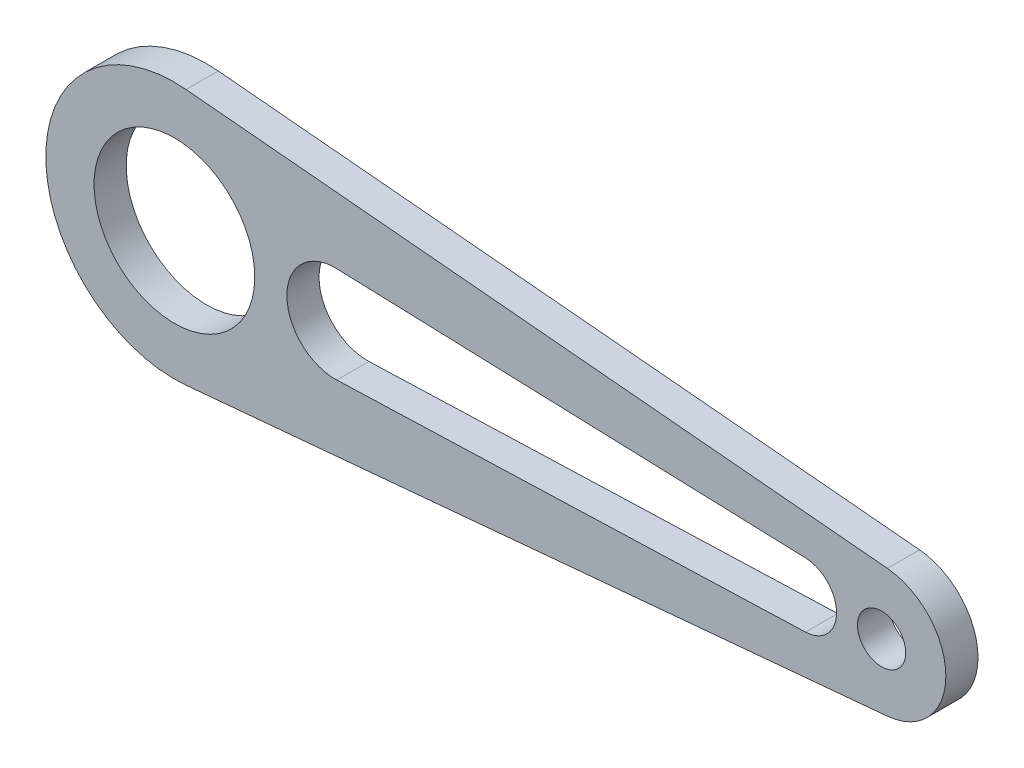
ISO-10303-21;
HEADER;
FILE_DESCRIPTION(('STEP AP214'),'2;1');
FILE_NAME('part.step','',(''),(''),'','','');
FILE_SCHEMA(('AUTOMOTIVE_DESIGN { 1 0 10303 214 1 1 1 1 }'));
ENDSEC;
DATA;
#1=APPLICATION_CONTEXT('core data for automotive mechanical design processes');
#2=APPLICATION_PROTOCOL_DEFINITION('international standard','automotive_design',2000,#1);
#3=PRODUCT_CONTEXT('',#1,'mechanical');
#4=PRODUCT('Part','Part','',(#3));
#5=PRODUCT_RELATED_PRODUCT_CATEGORY('part','',(#4));
#6=PRODUCT_DEFINITION_FORMATION('','',#4);
#7=PRODUCT_DEFINITION_CONTEXT('part definition',#1,'design');
#8=PRODUCT_DEFINITION('design','',#6,#7);
#9=PRODUCT_DEFINITION_SHAPE('','',#8);
#10=(LENGTH_UNIT() NAMED_UNIT(*) SI_UNIT(.MILLI.,.METRE.));
#11=(NAMED_UNIT(*) PLANE_ANGLE_UNIT() SI_UNIT($,.RADIAN.));
#12=(NAMED_UNIT(*) SI_UNIT($,.STERADIAN.) SOLID_ANGLE_UNIT());
#13=UNCERTAINTY_MEASURE_WITH_UNIT(LENGTH_MEASURE(1.E-05),#10,'distance_accuracy_value','');
#14=(GEOMETRIC_REPRESENTATION_CONTEXT(3) GLOBAL_UNCERTAINTY_ASSIGNED_CONTEXT((#13)) GLOBAL_UNIT_ASSIGNED_CONTEXT((#10,
#11,#12)) REPRESENTATION_CONTEXT('',''));
#15=CARTESIAN_POINT('',(0.,0.,0.));
#16=DIRECTION('',(0.,0.,1.));
#17=DIRECTION('',(1.,0.,0.));
#18=AXIS2_PLACEMENT_3D('',#15,#16,#17);
#19=CARTESIAN_POINT('',(0.,0.,1.5875));
#20=DIRECTION('',(0.,0.,1.));
#21=DIRECTION('',(1.,0.,0.));
#22=AXIS2_PLACEMENT_3D('',#19,#20,#21);
#23=PLANE('',#22);
#24=DIRECTION('',(0.999413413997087,0.0342465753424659,0.));
#25=VECTOR('',#24,1.);
#26=CARTESIAN_POINT('',(62.3387328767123,-3.17313758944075,1.5875));
#27=LINE('',#26,#25);
#28=CARTESIAN_POINT('',(16.0380993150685,-4.75970638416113,1.5875));
#29=VERTEX_POINT('',#28);
#30=CARTESIAN_POINT('',(62.3387328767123,-3.17313758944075,1.5875));
#31=VERTEX_POINT('',#30);
#32=EDGE_CURVE('E107',#29,#31,#27,.T.);
#33=ORIENTED_EDGE('',*,*,#32,.F.);
#34=CARTESIAN_POINT('',(15.875,0.,1.5875));
#35=DIRECTION('',(0.,0.,1.));
#36=DIRECTION('',(1.,0.,0.));
#37=AXIS2_PLACEMENT_3D('',#34,#35,#36);
#38=CIRCLE('',#37,4.7625);
#39=CARTESIAN_POINT('',(16.0380993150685,4.75970638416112,1.5875));
#40=VERTEX_POINT('',#39);
#41=EDGE_CURVE('E99',#40,#29,#38,.T.);
#42=ORIENTED_EDGE('',*,*,#41,.F.);
#43=DIRECTION('',(-0.999413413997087,0.0342465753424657,0.));
#44=VECTOR('',#43,1.);
#45=CARTESIAN_POINT('',(62.3387328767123,3.17313758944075,1.5875));
#46=LINE('',#45,#44);
#47=CARTESIAN_POINT('',(62.3387328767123,3.17313758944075,1.5875));
#48=VERTEX_POINT('',#47);
#49=EDGE_CURVE('E122',#48,#40,#46,.T.);
#50=ORIENTED_EDGE('',*,*,#49,.F.);
#51=CARTESIAN_POINT('',(62.23,0.,1.5875));
#52=DIRECTION('',(0.,0.,1.));
#53=DIRECTION('',(1.,0.,0.));
#54=AXIS2_PLACEMENT_3D('',#51,#52,#53);
#55=CIRCLE('',#54,3.175);
#56=EDGE_CURVE('E120',#31,#48,#55,.T.);
#57=ORIENTED_EDGE('',*,*,#56,.F.);
#58=EDGE_LOOP('',(#33,#42,#50,#57));
#59=FACE_BOUND('',#58,.T.);
#60=CARTESIAN_POINT('',(0.,0.,1.5875));
#61=DIRECTION('',(0.,0.,1.));
#62=DIRECTION('',(1.,0.,0.));
#63=AXIS2_PLACEMENT_3D('',#60,#61,#62);
#64=CIRCLE('',#63,12.7);
#65=CARTESIAN_POINT('',(1.15454545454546,12.647411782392,1.5875));
#66=VERTEX_POINT('',#65);
#67=CARTESIAN_POINT('',(1.15454545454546,-12.647411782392,1.5875));
#68=VERTEX_POINT('',#67);
#69=EDGE_CURVE('E144',#66,#68,#64,.T.);
#70=ORIENTED_EDGE('',*,*,#69,.T.);
#71=DIRECTION('',(0.995859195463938,0.0909090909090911,0.));
#72=VECTOR('',#71,1.);
#73=CARTESIAN_POINT('',(70.4272727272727,-6.32370589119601,1.5875));
#74=LINE('',#73,#72);
#75=CARTESIAN_POINT('',(70.4272727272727,-6.32370589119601,1.5875));
#76=VERTEX_POINT('',#75);
#77=EDGE_CURVE('E147',#68,#76,#74,.T.);
#78=ORIENTED_EDGE('',*,*,#77,.T.);
#79=CARTESIAN_POINT('',(69.85,0.,1.5875));
#80=DIRECTION('',(0.,0.,1.));
#81=DIRECTION('',(1.,0.,0.));
#82=AXIS2_PLACEMENT_3D('',#79,#80,#81);
#83=CIRCLE('',#82,6.35);
#84=CARTESIAN_POINT('',(70.4272727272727,6.32370589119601,1.5875));
#85=VERTEX_POINT('',#84);
#86=EDGE_CURVE('E150',#76,#85,#83,.T.);
#87=ORIENTED_EDGE('',*,*,#86,.T.);
#88=DIRECTION('',(-0.995859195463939,0.0909090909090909,0.));
#89=VECTOR('',#88,1.);
#90=CARTESIAN_POINT('',(1.15454545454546,12.647411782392,1.5875));
#91=LINE('',#90,#89);
#92=EDGE_CURVE('E152',#85,#66,#91,.T.);
#93=ORIENTED_EDGE('',*,*,#92,.T.);
#94=EDGE_LOOP('',(#70,#78,#87,#93));
#95=FACE_BOUND('',#94,.T.);
#96=CARTESIAN_POINT('',(0.,0.,1.5875));
#97=DIRECTION('',(0.,0.,1.));
#98=DIRECTION('',(1.,0.,0.));
#99=AXIS2_PLACEMENT_3D('',#96,#97,#98);
#100=CIRCLE('',#99,7.9375);
#101=CARTESIAN_POINT('',(7.9375,0.,1.5875));
#102=VERTEX_POINT('',#101);
#103=EDGE_CURVE('E138',#102,#102,#100,.T.);
#104=ORIENTED_EDGE('',*,*,#103,.F.);
#105=EDGE_LOOP('',(#104));
#106=FACE_BOUND('',#105,.T.);
#107=CARTESIAN_POINT('',(69.85,0.,1.5875));
#108=DIRECTION('',(0.,0.,1.));
#109=DIRECTION('',(1.,0.,0.));
#110=AXIS2_PLACEMENT_3D('',#107,#108,#109);
#111=CIRCLE('',#110,2.38125000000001);
#112=CARTESIAN_POINT('',(72.23125,0.,1.5875));
#113=VERTEX_POINT('',#112);
#114=EDGE_CURVE('E128',#113,#113,#111,.T.);
#115=ORIENTED_EDGE('',*,*,#114,.F.);
#116=EDGE_LOOP('',(#115));
#117=FACE_BOUND('',#116,.T.);
#118=ADVANCED_FACE('F34',(#59,#95,#106,#117),#23,.T.);
#119=CARTESIAN_POINT('',(0.,0.,-1.5875));
#120=DIRECTION('',(0.,0.,1.));
#121=DIRECTION('',(1.,0.,0.));
#122=AXIS2_PLACEMENT_3D('',#119,#120,#121);
#123=PLANE('',#122);
#124=CARTESIAN_POINT('',(15.875,0.,-1.5875));
#125=DIRECTION('',(0.,0.,1.));
#126=DIRECTION('',(1.,0.,0.));
#127=AXIS2_PLACEMENT_3D('',#124,#125,#126);
#128=CIRCLE('',#127,4.7625);
#129=CARTESIAN_POINT('',(16.0380993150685,4.75970638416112,-1.5875));
#130=VERTEX_POINT('',#129);
#131=CARTESIAN_POINT('',(16.0380993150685,-4.75970638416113,-1.5875));
#132=VERTEX_POINT('',#131);
#133=EDGE_CURVE('E57',#130,#132,#128,.T.);
#134=ORIENTED_EDGE('',*,*,#133,.T.);
#135=DIRECTION('',(0.999413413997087,0.0342465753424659,0.));
#136=VECTOR('',#135,1.);
#137=CARTESIAN_POINT('',(62.3387328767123,-3.17313758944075,-1.5875));
#138=LINE('',#137,#136);
#139=CARTESIAN_POINT('',(62.3387328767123,-3.17313758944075,-1.5875));
#140=VERTEX_POINT('',#139);
#141=EDGE_CURVE('E114',#132,#140,#138,.T.);
#142=ORIENTED_EDGE('',*,*,#141,.T.);
#143=CARTESIAN_POINT('',(62.23,0.,-1.5875));
#144=DIRECTION('',(0.,0.,1.));
#145=DIRECTION('',(1.,0.,0.));
#146=AXIS2_PLACEMENT_3D('',#143,#144,#145);
#147=CIRCLE('',#146,3.175);
#148=CARTESIAN_POINT('',(62.3387328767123,3.17313758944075,-1.5875));
#149=VERTEX_POINT('',#148);
#150=EDGE_CURVE('E130',#140,#149,#147,.T.);
#151=ORIENTED_EDGE('',*,*,#150,.T.);
#152=DIRECTION('',(-0.999413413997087,0.0342465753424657,0.));
#153=VECTOR('',#152,1.);
#154=CARTESIAN_POINT('',(62.3387328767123,3.17313758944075,-1.5875));
#155=LINE('',#154,#153);
#156=EDGE_CURVE('E108',#149,#130,#155,.T.);
#157=ORIENTED_EDGE('',*,*,#156,.T.);
#158=EDGE_LOOP('',(#134,#142,#151,#157));
#159=FACE_BOUND('',#158,.T.);
#160=CARTESIAN_POINT('',(0.,0.,-1.5875));
#161=DIRECTION('',(0.,0.,1.));
#162=DIRECTION('',(1.,0.,0.));
#163=AXIS2_PLACEMENT_3D('',#160,#161,#162);
#164=CIRCLE('',#163,12.7);
#165=CARTESIAN_POINT('',(1.15454545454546,12.647411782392,-1.5875));
#166=VERTEX_POINT('',#165);
#167=CARTESIAN_POINT('',(1.15454545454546,-12.647411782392,-1.5875));
#168=VERTEX_POINT('',#167);
#169=EDGE_CURVE('E141',#166,#168,#164,.T.);
#170=ORIENTED_EDGE('',*,*,#169,.F.);
#171=DIRECTION('',(-0.995859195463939,0.0909090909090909,0.));
#172=VECTOR('',#171,1.);
#173=CARTESIAN_POINT('',(1.15454545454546,12.647411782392,-1.5875));
#174=LINE('',#173,#172);
#175=CARTESIAN_POINT('',(70.4272727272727,6.32370589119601,-1.5875));
#176=VERTEX_POINT('',#175);
#177=EDGE_CURVE('E148',#176,#166,#174,.T.);
#178=ORIENTED_EDGE('',*,*,#177,.F.);
#179=CARTESIAN_POINT('',(69.85,0.,-1.5875));
#180=DIRECTION('',(0.,0.,1.));
#181=DIRECTION('',(1.,0.,0.));
#182=AXIS2_PLACEMENT_3D('',#179,#180,#181);
#183=CIRCLE('',#182,6.35);
#184=CARTESIAN_POINT('',(70.4272727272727,-6.32370589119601,-1.5875));
#185=VERTEX_POINT('',#184);
#186=EDGE_CURVE('E159',#185,#176,#183,.T.);
#187=ORIENTED_EDGE('',*,*,#186,.F.);
#188=DIRECTION('',(0.995859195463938,0.0909090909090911,0.));
#189=VECTOR('',#188,1.);
#190=CARTESIAN_POINT('',(70.4272727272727,-6.32370589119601,-1.5875));
#191=LINE('',#190,#189);
#192=EDGE_CURVE('E157',#168,#185,#191,.T.);
#193=ORIENTED_EDGE('',*,*,#192,.F.);
#194=EDGE_LOOP('',(#170,#178,#187,#193));
#195=FACE_BOUND('',#194,.T.);
#196=CARTESIAN_POINT('',(0.,0.,-1.5875));
#197=DIRECTION('',(0.,0.,1.));
#198=DIRECTION('',(1.,0.,0.));
#199=AXIS2_PLACEMENT_3D('',#196,#197,#198);
#200=CIRCLE('',#199,7.9375);
#201=CARTESIAN_POINT('',(7.9375,0.,-1.5875));
#202=VERTEX_POINT('',#201);
#203=EDGE_CURVE('E115',#202,#202,#200,.T.);
#204=ORIENTED_EDGE('',*,*,#203,.T.);
#205=EDGE_LOOP('',(#204));
#206=FACE_BOUND('',#205,.T.);
#207=CARTESIAN_POINT('',(69.85,0.,-1.5875));
#208=DIRECTION('',(0.,0.,1.));
#209=DIRECTION('',(1.,0.,0.));
#210=AXIS2_PLACEMENT_3D('',#207,#208,#209);
#211=CIRCLE('',#210,2.38125000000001);
#212=CARTESIAN_POINT('',(72.23125,0.,-1.5875));
#213=VERTEX_POINT('',#212);
#214=EDGE_CURVE('E219',#213,#213,#211,.T.);
#215=ORIENTED_EDGE('',*,*,#214,.T.);
#216=EDGE_LOOP('',(#215));
#217=FACE_BOUND('',#216,.T.);
#218=ADVANCED_FACE('F177',(#159,#195,#206,#217),#123,.F.);
#219=CARTESIAN_POINT('',(0.,0.,1.5875));
#220=DIRECTION('',(0.,0.,-1.));
#221=DIRECTION('',(-1.,0.,0.));
#222=AXIS2_PLACEMENT_3D('',#219,#220,#221);
#223=CYLINDRICAL_SURFACE('',#222,12.7);
#224=ORIENTED_EDGE('',*,*,#169,.T.);
#225=DIRECTION('',(0.,0.,-1.));
#226=VECTOR('',#225,1.);
#227=CARTESIAN_POINT('',(1.15454545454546,-12.647411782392,1.5875));
#228=LINE('',#227,#226);
#229=EDGE_CURVE('E11',#68,#168,#228,.T.);
#230=ORIENTED_EDGE('',*,*,#229,.F.);
#231=ORIENTED_EDGE('',*,*,#69,.F.);
#232=DIRECTION('',(0.,0.,-1.));
#233=VECTOR('',#232,1.);
#234=CARTESIAN_POINT('',(1.15454545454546,12.647411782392,1.5875));
#235=LINE('',#234,#233);
#236=EDGE_CURVE('E154',#66,#166,#235,.T.);
#237=ORIENTED_EDGE('',*,*,#236,.T.);
#238=EDGE_LOOP('',(#224,#230,#231,#237));
#239=FACE_BOUND('',#238,.T.);
#240=ADVANCED_FACE('F36',(#239),#223,.T.);
#241=CARTESIAN_POINT('',(70.4272727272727,-6.32370589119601,1.5875));
#242=DIRECTION('',(-0.0909090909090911,0.995859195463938,0.));
#243=DIRECTION('',(-0.995859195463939,-0.0909090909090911,0.));
#244=AXIS2_PLACEMENT_3D('',#241,#242,#243);
#245=PLANE('',#244);
#246=ORIENTED_EDGE('',*,*,#192,.T.);
#247=DIRECTION('',(0.,0.,-1.));
#248=VECTOR('',#247,1.);
#249=CARTESIAN_POINT('',(70.4272727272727,-6.32370589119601,1.5875));
#250=LINE('',#249,#248);
#251=EDGE_CURVE('E42',#76,#185,#250,.T.);
#252=ORIENTED_EDGE('',*,*,#251,.F.);
#253=ORIENTED_EDGE('',*,*,#77,.F.);
#254=ORIENTED_EDGE('',*,*,#229,.T.);
#255=EDGE_LOOP('',(#246,#252,#253,#254));
#256=FACE_BOUND('',#255,.T.);
#257=ADVANCED_FACE('F187',(#256),#245,.F.);
#258=CARTESIAN_POINT('',(69.85,0.,1.5875));
#259=DIRECTION('',(0.,0.,-1.));
#260=DIRECTION('',(-1.,0.,0.));
#261=AXIS2_PLACEMENT_3D('',#258,#259,#260);
#262=CYLINDRICAL_SURFACE('',#261,6.35);
#263=ORIENTED_EDGE('',*,*,#186,.T.);
#264=DIRECTION('',(0.,0.,-1.));
#265=VECTOR('',#264,1.);
#266=CARTESIAN_POINT('',(70.4272727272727,6.32370589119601,1.5875));
#267=LINE('',#266,#265);
#268=EDGE_CURVE('E164',#85,#176,#267,.T.);
#269=ORIENTED_EDGE('',*,*,#268,.F.);
#270=ORIENTED_EDGE('',*,*,#86,.F.);
#271=ORIENTED_EDGE('',*,*,#251,.T.);
#272=EDGE_LOOP('',(#263,#269,#270,#271));
#273=FACE_BOUND('',#272,.T.);
#274=ADVANCED_FACE('F171',(#273),#262,.T.);
#275=CARTESIAN_POINT('',(1.15454545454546,12.647411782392,1.5875));
#276=DIRECTION('',(-0.0909090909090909,-0.995859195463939,0.));
#277=DIRECTION('',(0.995859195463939,-0.0909090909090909,0.));
#278=AXIS2_PLACEMENT_3D('',#275,#276,#277);
#279=PLANE('',#278);
#280=ORIENTED_EDGE('',*,*,#177,.T.);
#281=ORIENTED_EDGE('',*,*,#236,.F.);
#282=ORIENTED_EDGE('',*,*,#92,.F.);
#283=ORIENTED_EDGE('',*,*,#268,.T.);
#284=EDGE_LOOP('',(#280,#281,#282,#283));
#285=FACE_BOUND('',#284,.T.);
#286=ADVANCED_FACE('F181',(#285),#279,.F.);
#287=CARTESIAN_POINT('',(0.,0.,1.5875));
#288=DIRECTION('',(0.,0.,-1.));
#289=DIRECTION('',(-1.,0.,0.));
#290=AXIS2_PLACEMENT_3D('',#287,#288,#289);
#291=CYLINDRICAL_SURFACE('',#290,7.9375);
#292=ORIENTED_EDGE('',*,*,#103,.T.);
#293=EDGE_LOOP('',(#292));
#294=FACE_BOUND('',#293,.T.);
#295=ORIENTED_EDGE('',*,*,#203,.F.);
#296=EDGE_LOOP('',(#295));
#297=FACE_BOUND('',#296,.T.);
#298=ADVANCED_FACE('F202',(#294,#297),#291,.F.);
#299=CARTESIAN_POINT('',(15.875,0.,1.5875));
#300=DIRECTION('',(0.,0.,-1.));
#301=DIRECTION('',(-1.,0.,0.));
#302=AXIS2_PLACEMENT_3D('',#299,#300,#301);
#303=CYLINDRICAL_SURFACE('',#302,4.7625);
#304=ORIENTED_EDGE('',*,*,#133,.F.);
#305=DIRECTION('',(0.,0.,-1.));
#306=VECTOR('',#305,1.);
#307=CARTESIAN_POINT('',(16.0380993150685,4.75970638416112,1.5875));
#308=LINE('',#307,#306);
#309=EDGE_CURVE('E103',#40,#130,#308,.T.);
#310=ORIENTED_EDGE('',*,*,#309,.F.);
#311=ORIENTED_EDGE('',*,*,#41,.T.);
#312=DIRECTION('',(0.,0.,-1.));
#313=VECTOR('',#312,1.);
#314=CARTESIAN_POINT('',(16.0380993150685,-4.75970638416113,1.5875));
#315=LINE('',#314,#313);
#316=EDGE_CURVE('E102',#29,#132,#315,.T.);
#317=ORIENTED_EDGE('',*,*,#316,.T.);
#318=EDGE_LOOP('',(#304,#310,#311,#317));
#319=FACE_BOUND('',#318,.T.);
#320=ADVANCED_FACE('F101',(#319),#303,.F.);
#321=CARTESIAN_POINT('',(62.3387328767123,-3.17313758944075,1.5875));
#322=DIRECTION('',(-0.0342465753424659,0.999413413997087,0.));
#323=DIRECTION('',(-0.999413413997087,-0.0342465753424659,0.));
#324=AXIS2_PLACEMENT_3D('',#321,#322,#323);
#325=PLANE('',#324);
#326=ORIENTED_EDGE('',*,*,#141,.F.);
#327=ORIENTED_EDGE('',*,*,#316,.F.);
#328=ORIENTED_EDGE('',*,*,#32,.T.);
#329=DIRECTION('',(0.,0.,-1.));
#330=VECTOR('',#329,1.);
#331=CARTESIAN_POINT('',(62.3387328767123,-3.17313758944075,1.5875));
#332=LINE('',#331,#330);
#333=EDGE_CURVE('E116',#31,#140,#332,.T.);
#334=ORIENTED_EDGE('',*,*,#333,.T.);
#335=EDGE_LOOP('',(#326,#327,#328,#334));
#336=FACE_BOUND('',#335,.T.);
#337=ADVANCED_FACE('F111',(#336),#325,.T.);
#338=CARTESIAN_POINT('',(62.23,0.,1.5875));
#339=DIRECTION('',(0.,0.,-1.));
#340=DIRECTION('',(-1.,0.,0.));
#341=AXIS2_PLACEMENT_3D('',#338,#339,#340);
#342=CYLINDRICAL_SURFACE('',#341,3.175);
#343=ORIENTED_EDGE('',*,*,#150,.F.);
#344=ORIENTED_EDGE('',*,*,#333,.F.);
#345=ORIENTED_EDGE('',*,*,#56,.T.);
#346=DIRECTION('',(0.,0.,-1.));
#347=VECTOR('',#346,1.);
#348=CARTESIAN_POINT('',(62.3387328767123,3.17313758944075,1.5875));
#349=LINE('',#348,#347);
#350=EDGE_CURVE('E49',#48,#149,#349,.T.);
#351=ORIENTED_EDGE('',*,*,#350,.T.);
#352=EDGE_LOOP('',(#343,#344,#345,#351));
#353=FACE_BOUND('',#352,.T.);
#354=ADVANCED_FACE('F233',(#353),#342,.F.);
#355=CARTESIAN_POINT('',(62.3387328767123,3.17313758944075,1.5875));
#356=DIRECTION('',(-0.0342465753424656,-0.999413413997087,0.));
#357=DIRECTION('',(0.999413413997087,-0.0342465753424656,0.));
#358=AXIS2_PLACEMENT_3D('',#355,#356,#357);
#359=PLANE('',#358);
#360=ORIENTED_EDGE('',*,*,#156,.F.);
#361=ORIENTED_EDGE('',*,*,#350,.F.);
#362=ORIENTED_EDGE('',*,*,#49,.T.);
#363=ORIENTED_EDGE('',*,*,#309,.T.);
#364=EDGE_LOOP('',(#360,#361,#362,#363));
#365=FACE_BOUND('',#364,.T.);
#366=ADVANCED_FACE('F228',(#365),#359,.T.);
#367=CARTESIAN_POINT('',(69.85,0.,1.5875));
#368=DIRECTION('',(0.,0.,-1.));
#369=DIRECTION('',(-1.,0.,0.));
#370=AXIS2_PLACEMENT_3D('',#367,#368,#369);
#371=CYLINDRICAL_SURFACE('',#370,2.38125000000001);
#372=ORIENTED_EDGE('',*,*,#114,.T.);
#373=EDGE_LOOP('',(#372));
#374=FACE_BOUND('',#373,.T.);
#375=ORIENTED_EDGE('',*,*,#214,.F.);
#376=EDGE_LOOP('',(#375));
#377=FACE_BOUND('',#376,.T.);
#378=ADVANCED_FACE('F225',(#374,#377),#371,.F.);
#379=CLOSED_SHELL('',(#118,#218,#240,#257,#274,#286,#298,#320,#337,#354,#366,#378));
#380=MANIFOLD_SOLID_BREP('B2',#379);
#381=ADVANCED_BREP_SHAPE_REPRESENTATION('',(#18,#380),#14);
#382=SHAPE_DEFINITION_REPRESENTATION(#9,#381);
ENDSEC;
END-ISO-10303-21;
